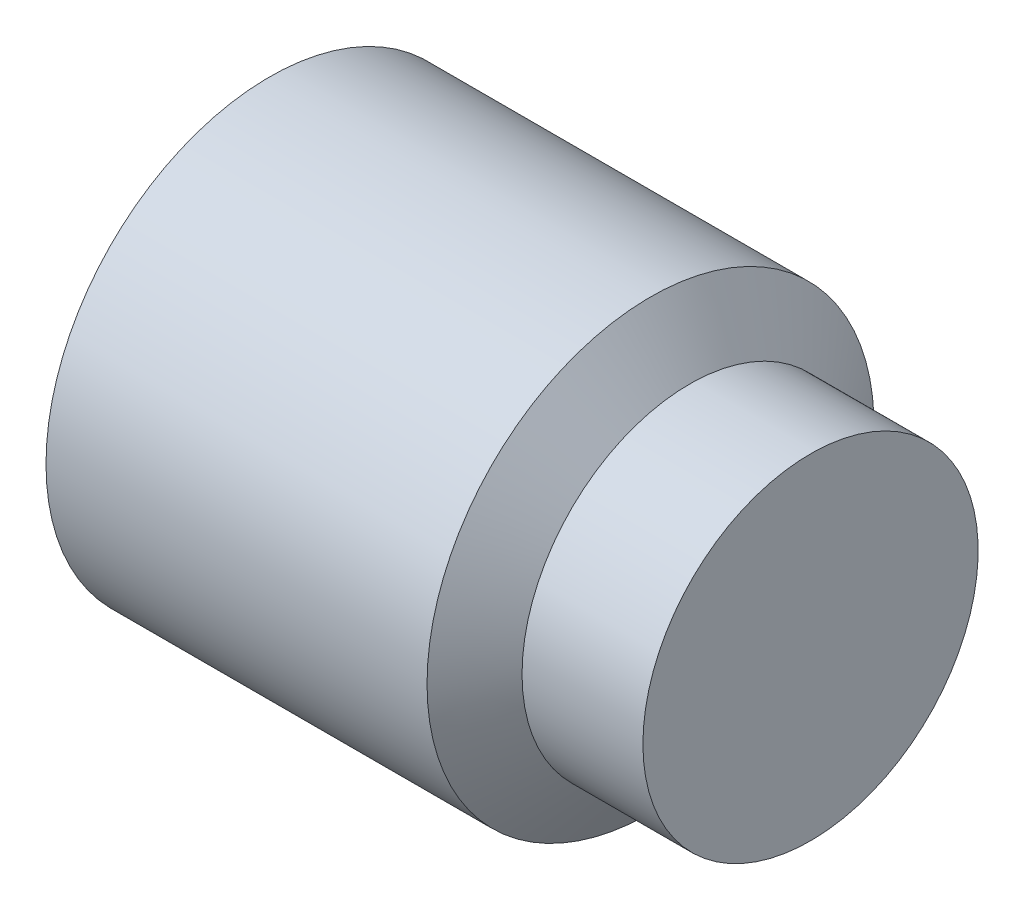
ISO-10303-21;
HEADER;
FILE_DESCRIPTION(('STEP AP214'),'2;1');
FILE_NAME('part.step','',(''),(''),'','','');
FILE_SCHEMA(('AUTOMOTIVE_DESIGN { 1 0 10303 214 1 1 1 1 }'));
ENDSEC;
DATA;
#1=APPLICATION_CONTEXT('core data for automotive mechanical design processes');
#2=APPLICATION_PROTOCOL_DEFINITION('international standard','automotive_design',2000,#1);
#3=PRODUCT_CONTEXT('',#1,'mechanical');
#4=PRODUCT('Part','Part','',(#3));
#5=PRODUCT_RELATED_PRODUCT_CATEGORY('part','',(#4));
#6=PRODUCT_DEFINITION_FORMATION('','',#4);
#7=PRODUCT_DEFINITION_CONTEXT('part definition',#1,'design');
#8=PRODUCT_DEFINITION('design','',#6,#7);
#9=PRODUCT_DEFINITION_SHAPE('','',#8);
#10=(LENGTH_UNIT() NAMED_UNIT(*) SI_UNIT(.MILLI.,.METRE.));
#11=(NAMED_UNIT(*) PLANE_ANGLE_UNIT() SI_UNIT($,.RADIAN.));
#12=(NAMED_UNIT(*) SI_UNIT($,.STERADIAN.) SOLID_ANGLE_UNIT());
#13=UNCERTAINTY_MEASURE_WITH_UNIT(LENGTH_MEASURE(1.E-05),#10,'distance_accuracy_value','');
#14=(GEOMETRIC_REPRESENTATION_CONTEXT(3) GLOBAL_UNCERTAINTY_ASSIGNED_CONTEXT((#13)) GLOBAL_UNIT_ASSIGNED_CONTEXT((#10,
#11,#12)) REPRESENTATION_CONTEXT('',''));
#15=CARTESIAN_POINT('',(0.,0.,0.));
#16=DIRECTION('',(0.,0.,1.));
#17=DIRECTION('',(1.,0.,0.));
#18=AXIS2_PLACEMENT_3D('',#15,#16,#17);
#19=CARTESIAN_POINT('',(0.,0.,0.));
#20=DIRECTION('',(-1.,0.,0.));
#21=DIRECTION('',(0.,0.,1.));
#22=AXIS2_PLACEMENT_3D('',#19,#20,#21);
#23=PLANE('',#22);
#24=CARTESIAN_POINT('',(0.,0.,0.));
#25=DIRECTION('',(-1.,0.,0.));
#26=DIRECTION('',(0.,0.,1.));
#27=AXIS2_PLACEMENT_3D('',#24,#25,#26);
#28=CIRCLE('',#27,10.352);
#29=CARTESIAN_POINT('',(0.,0.,10.352));
#30=VERTEX_POINT('',#29);
#31=EDGE_CURVE('E11',#30,#30,#28,.T.);
#32=ORIENTED_EDGE('',*,*,#31,.T.);
#33=EDGE_LOOP('',(#32));
#34=FACE_BOUND('',#33,.T.);
#35=DIRECTION('',(0.,0.,-1.));
#36=VECTOR('',#35,1.);
#37=CARTESIAN_POINT('',(0.,6.,3.46410161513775));
#38=LINE('',#37,#36);
#39=CARTESIAN_POINT('',(0.,6.,3.46410161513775));
#40=VERTEX_POINT('',#39);
#41=CARTESIAN_POINT('',(0.,6.,-3.46410161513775));
#42=VERTEX_POINT('',#41);
#43=EDGE_CURVE('E126',#40,#42,#38,.T.);
#44=ORIENTED_EDGE('',*,*,#43,.F.);
#45=DIRECTION('',(0.,-0.866025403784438,0.5));
#46=VECTOR('',#45,1.);
#47=CARTESIAN_POINT('',(0.,6.,3.46410161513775));
#48=LINE('',#47,#46);
#49=CARTESIAN_POINT('',(0.,0.,6.92820323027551));
#50=VERTEX_POINT('',#49);
#51=EDGE_CURVE('E48',#40,#50,#48,.T.);
#52=ORIENTED_EDGE('',*,*,#51,.T.);
#53=DIRECTION('',(0.,0.866025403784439,0.5));
#54=VECTOR('',#53,1.);
#55=CARTESIAN_POINT('',(0.,-5.99999999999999,3.46410161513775));
#56=LINE('',#55,#54);
#57=CARTESIAN_POINT('',(0.,-5.99999999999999,3.46410161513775));
#58=VERTEX_POINT('',#57);
#59=EDGE_CURVE('E117',#58,#50,#56,.T.);
#60=ORIENTED_EDGE('',*,*,#59,.F.);
#61=DIRECTION('',(0.,0.,-1.));
#62=VECTOR('',#61,1.);
#63=CARTESIAN_POINT('',(0.,-5.99999999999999,3.46410161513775));
#64=LINE('',#63,#62);
#65=CARTESIAN_POINT('',(0.,-5.99999999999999,-3.46410161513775));
#66=VERTEX_POINT('',#65);
#67=EDGE_CURVE('E120',#58,#66,#64,.T.);
#68=ORIENTED_EDGE('',*,*,#67,.T.);
#69=DIRECTION('',(0.,0.866025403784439,-0.5));
#70=VECTOR('',#69,1.);
#71=CARTESIAN_POINT('',(0.,-5.99999999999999,-3.46410161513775));
#72=LINE('',#71,#70);
#73=CARTESIAN_POINT('',(0.,0.,-6.92820323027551));
#74=VERTEX_POINT('',#73);
#75=EDGE_CURVE('E123',#66,#74,#72,.T.);
#76=ORIENTED_EDGE('',*,*,#75,.T.);
#77=DIRECTION('',(0.,-0.866025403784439,-0.5));
#78=VECTOR('',#77,1.);
#79=CARTESIAN_POINT('',(0.,6.,-3.46410161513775));
#80=LINE('',#79,#78);
#81=EDGE_CURVE('E106',#42,#74,#80,.T.);
#82=ORIENTED_EDGE('',*,*,#81,.F.);
#83=EDGE_LOOP('',(#44,#52,#60,#68,#76,#82));
#84=FACE_BOUND('',#83,.T.);
#85=ADVANCED_FACE('F34',(#34,#84),#23,.T.);
#86=CARTESIAN_POINT('',(0.,0.,0.));
#87=DIRECTION('',(1.,0.,0.));
#88=DIRECTION('',(0.,0.,-1.));
#89=AXIS2_PLACEMENT_3D('',#86,#87,#88);
#90=CONICAL_SURFACE('',#89,10.352,1.0471975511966);
#91=CARTESIAN_POINT('',(0.951473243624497,0.,0.));
#92=DIRECTION('',(-1.,0.,0.));
#93=DIRECTION('',(0.,0.,1.));
#94=AXIS2_PLACEMENT_3D('',#91,#92,#93);
#95=CIRCLE('',#94,12.);
#96=CARTESIAN_POINT('',(0.951473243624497,0.,12.));
#97=VERTEX_POINT('',#96);
#98=EDGE_CURVE('E41',#97,#97,#95,.T.);
#99=ORIENTED_EDGE('',*,*,#98,.T.);
#100=EDGE_LOOP('',(#99));
#101=FACE_BOUND('',#100,.T.);
#102=ORIENTED_EDGE('',*,*,#31,.F.);
#103=EDGE_LOOP('',(#102));
#104=FACE_BOUND('',#103,.T.);
#105=ADVANCED_FACE('F146',(#101,#104),#90,.T.);
#106=CARTESIAN_POINT('',(-12.7,0.,0.));
#107=DIRECTION('',(-1.,0.,0.));
#108=DIRECTION('',(0.,0.,1.));
#109=AXIS2_PLACEMENT_3D('',#106,#107,#108);
#110=CYLINDRICAL_SURFACE('',#109,12.);
#111=CARTESIAN_POINT('',(21.4093773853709,0.,0.));
#112=DIRECTION('',(-1.,0.,0.));
#113=DIRECTION('',(0.,0.,1.));
#114=AXIS2_PLACEMENT_3D('',#111,#112,#113);
#115=CIRCLE('',#114,12.);
#116=CARTESIAN_POINT('',(21.4093773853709,0.,12.));
#117=VERTEX_POINT('',#116);
#118=EDGE_CURVE('E141',#117,#117,#115,.T.);
#119=ORIENTED_EDGE('',*,*,#118,.T.);
#120=EDGE_LOOP('',(#119));
#121=FACE_BOUND('',#120,.T.);
#122=ORIENTED_EDGE('',*,*,#98,.F.);
#123=EDGE_LOOP('',(#122));
#124=FACE_BOUND('',#123,.T.);
#125=ADVANCED_FACE('F149',(#121,#124),#110,.T.);
#126=CARTESIAN_POINT('',(21.4093773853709,0.,0.));
#127=DIRECTION('',(-1.,0.,0.));
#128=DIRECTION('',(0.,0.,1.));
#129=AXIS2_PLACEMENT_3D('',#126,#127,#128);
#130=CONICAL_SURFACE('',#129,12.,0.959931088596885);
#131=CARTESIAN_POINT('',(23.51,0.,0.));
#132=DIRECTION('',(-1.,0.,0.));
#133=DIRECTION('',(0.,0.,1.));
#134=AXIS2_PLACEMENT_3D('',#131,#132,#133);
#135=CIRCLE('',#134,9.);
#136=CARTESIAN_POINT('',(23.51,0.,9.));
#137=VERTEX_POINT('',#136);
#138=EDGE_CURVE('E138',#137,#137,#135,.T.);
#139=ORIENTED_EDGE('',*,*,#138,.T.);
#140=EDGE_LOOP('',(#139));
#141=FACE_BOUND('',#140,.T.);
#142=ORIENTED_EDGE('',*,*,#118,.F.);
#143=EDGE_LOOP('',(#142));
#144=FACE_BOUND('',#143,.T.);
#145=ADVANCED_FACE('F151',(#141,#144),#130,.T.);
#146=CARTESIAN_POINT('',(-12.7,0.,0.));
#147=DIRECTION('',(-1.,0.,0.));
#148=DIRECTION('',(0.,0.,1.));
#149=AXIS2_PLACEMENT_3D('',#146,#147,#148);
#150=CYLINDRICAL_SURFACE('',#149,9.);
#151=CARTESIAN_POINT('',(30.,0.,0.));
#152=DIRECTION('',(-1.,0.,0.));
#153=DIRECTION('',(0.,0.,1.));
#154=AXIS2_PLACEMENT_3D('',#151,#152,#153);
#155=CIRCLE('',#154,9.);
#156=CARTESIAN_POINT('',(30.,0.,9.));
#157=VERTEX_POINT('',#156);
#158=EDGE_CURVE('E135',#157,#157,#155,.T.);
#159=ORIENTED_EDGE('',*,*,#158,.T.);
#160=EDGE_LOOP('',(#159));
#161=FACE_BOUND('',#160,.T.);
#162=ORIENTED_EDGE('',*,*,#138,.F.);
#163=EDGE_LOOP('',(#162));
#164=FACE_BOUND('',#163,.T.);
#165=ADVANCED_FACE('F158',(#161,#164),#150,.T.);
#166=CARTESIAN_POINT('',(30.,9.,0.));
#167=DIRECTION('',(1.,0.,0.));
#168=DIRECTION('',(0.,0.,-1.));
#169=AXIS2_PLACEMENT_3D('',#166,#167,#168);
#170=PLANE('',#169);
#171=ORIENTED_EDGE('',*,*,#158,.F.);
#172=EDGE_LOOP('',(#171));
#173=FACE_BOUND('',#172,.T.);
#174=ADVANCED_FACE('F193',(#173),#170,.T.);
#175=CARTESIAN_POINT('',(12.,6.,3.46410161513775));
#176=DIRECTION('',(0.,-0.5,-0.866025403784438));
#177=DIRECTION('',(0.,0.866025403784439,-0.5));
#178=AXIS2_PLACEMENT_3D('',#175,#176,#177);
#179=PLANE('',#178);
#180=ORIENTED_EDGE('',*,*,#51,.F.);
#181=DIRECTION('',(-1.,0.,0.));
#182=VECTOR('',#181,1.);
#183=CARTESIAN_POINT('',(12.,6.,3.46410161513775));
#184=LINE('',#183,#182);
#185=CARTESIAN_POINT('',(12.,6.,3.46410161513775));
#186=VERTEX_POINT('',#185);
#187=EDGE_CURVE('E53',#186,#40,#184,.T.);
#188=ORIENTED_EDGE('',*,*,#187,.F.);
#189=DIRECTION('',(0.,-0.866025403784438,0.5));
#190=VECTOR('',#189,1.);
#191=CARTESIAN_POINT('',(12.,6.,3.46410161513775));
#192=LINE('',#191,#190);
#193=CARTESIAN_POINT('',(12.,0.,6.92820323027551));
#194=VERTEX_POINT('',#193);
#195=EDGE_CURVE('E80',#186,#194,#192,.T.);
#196=ORIENTED_EDGE('',*,*,#195,.T.);
#197=DIRECTION('',(-1.,0.,0.));
#198=VECTOR('',#197,1.);
#199=CARTESIAN_POINT('',(12.,0.,6.92820323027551));
#200=LINE('',#199,#198);
#201=EDGE_CURVE('E133',#194,#50,#200,.T.);
#202=ORIENTED_EDGE('',*,*,#201,.T.);
#203=EDGE_LOOP('',(#180,#188,#196,#202));
#204=FACE_BOUND('',#203,.T.);
#205=ADVANCED_FACE('F189',(#204),#179,.T.);
#206=CARTESIAN_POINT('',(12.,-5.99999999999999,3.46410161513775));
#207=DIRECTION('',(0.,-0.5,0.866025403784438));
#208=DIRECTION('',(0.,-0.866025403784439,-0.5));
#209=AXIS2_PLACEMENT_3D('',#206,#207,#208);
#210=PLANE('',#209);
#211=ORIENTED_EDGE('',*,*,#59,.T.);
#212=ORIENTED_EDGE('',*,*,#201,.F.);
#213=DIRECTION('',(0.,0.866025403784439,0.5));
#214=VECTOR('',#213,1.);
#215=CARTESIAN_POINT('',(12.,-5.99999999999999,3.46410161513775));
#216=LINE('',#215,#214);
#217=CARTESIAN_POINT('',(12.,-5.99999999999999,3.46410161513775));
#218=VERTEX_POINT('',#217);
#219=EDGE_CURVE('E283',#218,#194,#216,.T.);
#220=ORIENTED_EDGE('',*,*,#219,.F.);
#221=DIRECTION('',(-1.,0.,0.));
#222=VECTOR('',#221,1.);
#223=CARTESIAN_POINT('',(12.,-5.99999999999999,3.46410161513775));
#224=LINE('',#223,#222);
#225=EDGE_CURVE('E131',#218,#58,#224,.T.);
#226=ORIENTED_EDGE('',*,*,#225,.T.);
#227=EDGE_LOOP('',(#211,#212,#220,#226));
#228=FACE_BOUND('',#227,.T.);
#229=ADVANCED_FACE('F185',(#228),#210,.F.);
#230=CARTESIAN_POINT('',(12.,-5.99999999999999,3.46410161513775));
#231=DIRECTION('',(0.,1.,0.));
#232=DIRECTION('',(0.,0.,1.));
#233=AXIS2_PLACEMENT_3D('',#230,#231,#232);
#234=PLANE('',#233);
#235=ORIENTED_EDGE('',*,*,#67,.F.);
#236=ORIENTED_EDGE('',*,*,#225,.F.);
#237=DIRECTION('',(0.,0.,-1.));
#238=VECTOR('',#237,1.);
#239=CARTESIAN_POINT('',(12.,-5.99999999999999,3.46410161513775));
#240=LINE('',#239,#238);
#241=CARTESIAN_POINT('',(12.,-5.99999999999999,-3.46410161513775));
#242=VERTEX_POINT('',#241);
#243=EDGE_CURVE('E101',#218,#242,#240,.T.);
#244=ORIENTED_EDGE('',*,*,#243,.T.);
#245=DIRECTION('',(-1.,0.,0.));
#246=VECTOR('',#245,1.);
#247=CARTESIAN_POINT('',(12.,-5.99999999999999,-3.46410161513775));
#248=LINE('',#247,#246);
#249=EDGE_CURVE('E96',#242,#66,#248,.T.);
#250=ORIENTED_EDGE('',*,*,#249,.T.);
#251=EDGE_LOOP('',(#235,#236,#244,#250));
#252=FACE_BOUND('',#251,.T.);
#253=ADVANCED_FACE('F182',(#252),#234,.T.);
#254=CARTESIAN_POINT('',(12.,-5.99999999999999,-3.46410161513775));
#255=DIRECTION('',(0.,0.5,0.866025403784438));
#256=DIRECTION('',(0.,-0.866025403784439,0.5));
#257=AXIS2_PLACEMENT_3D('',#254,#255,#256);
#258=PLANE('',#257);
#259=ORIENTED_EDGE('',*,*,#75,.F.);
#260=ORIENTED_EDGE('',*,*,#249,.F.);
#261=DIRECTION('',(0.,0.866025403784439,-0.5));
#262=VECTOR('',#261,1.);
#263=CARTESIAN_POINT('',(12.,-5.99999999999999,-3.46410161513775));
#264=LINE('',#263,#262);
#265=CARTESIAN_POINT('',(12.,0.,-6.92820323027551));
#266=VERTEX_POINT('',#265);
#267=EDGE_CURVE('E91',#242,#266,#264,.T.);
#268=ORIENTED_EDGE('',*,*,#267,.T.);
#269=DIRECTION('',(-1.,0.,0.));
#270=VECTOR('',#269,1.);
#271=CARTESIAN_POINT('',(12.,0.,-6.92820323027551));
#272=LINE('',#271,#270);
#273=EDGE_CURVE('E95',#266,#74,#272,.T.);
#274=ORIENTED_EDGE('',*,*,#273,.T.);
#275=EDGE_LOOP('',(#259,#260,#268,#274));
#276=FACE_BOUND('',#275,.T.);
#277=ADVANCED_FACE('F94',(#276),#258,.T.);
#278=CARTESIAN_POINT('',(12.,6.,-3.46410161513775));
#279=DIRECTION('',(0.,0.5,-0.866025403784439));
#280=DIRECTION('',(0.,0.866025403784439,0.5));
#281=AXIS2_PLACEMENT_3D('',#278,#279,#280);
#282=PLANE('',#281);
#283=ORIENTED_EDGE('',*,*,#81,.T.);
#284=ORIENTED_EDGE('',*,*,#273,.F.);
#285=DIRECTION('',(0.,-0.866025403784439,-0.5));
#286=VECTOR('',#285,1.);
#287=CARTESIAN_POINT('',(12.,6.,-3.46410161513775));
#288=LINE('',#287,#286);
#289=CARTESIAN_POINT('',(12.,6.,-3.46410161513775));
#290=VERTEX_POINT('',#289);
#291=EDGE_CURVE('E100',#290,#266,#288,.T.);
#292=ORIENTED_EDGE('',*,*,#291,.F.);
#293=DIRECTION('',(-1.,0.,0.));
#294=VECTOR('',#293,1.);
#295=CARTESIAN_POINT('',(12.,6.,-3.46410161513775));
#296=LINE('',#295,#294);
#297=EDGE_CURVE('E76',#290,#42,#296,.T.);
#298=ORIENTED_EDGE('',*,*,#297,.T.);
#299=EDGE_LOOP('',(#283,#284,#292,#298));
#300=FACE_BOUND('',#299,.T.);
#301=ADVANCED_FACE('F103',(#300),#282,.F.);
#302=CARTESIAN_POINT('',(12.,6.,3.46410161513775));
#303=DIRECTION('',(0.,1.,0.));
#304=DIRECTION('',(0.,0.,1.));
#305=AXIS2_PLACEMENT_3D('',#302,#303,#304);
#306=PLANE('',#305);
#307=ORIENTED_EDGE('',*,*,#43,.T.);
#308=ORIENTED_EDGE('',*,*,#297,.F.);
#309=DIRECTION('',(0.,0.,-1.));
#310=VECTOR('',#309,1.);
#311=CARTESIAN_POINT('',(12.,6.,3.46410161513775));
#312=LINE('',#311,#310);
#313=EDGE_CURVE('E111',#186,#290,#312,.T.);
#314=ORIENTED_EDGE('',*,*,#313,.F.);
#315=ORIENTED_EDGE('',*,*,#187,.T.);
#316=EDGE_LOOP('',(#307,#308,#314,#315));
#317=FACE_BOUND('',#316,.T.);
#318=ADVANCED_FACE('F170',(#317),#306,.F.);
#319=CARTESIAN_POINT('',(12.,0.,6.92820323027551));
#320=DIRECTION('',(-1.,0.,0.));
#321=DIRECTION('',(0.,0.,1.));
#322=AXIS2_PLACEMENT_3D('',#319,#320,#321);
#323=PLANE('',#322);
#324=ORIENTED_EDGE('',*,*,#195,.F.);
#325=ORIENTED_EDGE('',*,*,#313,.T.);
#326=ORIENTED_EDGE('',*,*,#291,.T.);
#327=ORIENTED_EDGE('',*,*,#267,.F.);
#328=ORIENTED_EDGE('',*,*,#243,.F.);
#329=ORIENTED_EDGE('',*,*,#219,.T.);
#330=EDGE_LOOP('',(#324,#325,#326,#327,#328,#329));
#331=FACE_BOUND('',#330,.T.);
#332=ADVANCED_FACE('F109',(#331),#323,.T.);
#333=CLOSED_SHELL('',(#85,#105,#125,#145,#165,#174,#205,#229,#253,#277,#301,#318,#332));
#334=MANIFOLD_SOLID_BREP('B2',#333);
#335=ADVANCED_BREP_SHAPE_REPRESENTATION('',(#18,#334),#14);
#336=SHAPE_DEFINITION_REPRESENTATION(#9,#335);
ENDSEC;
END-ISO-10303-21;
